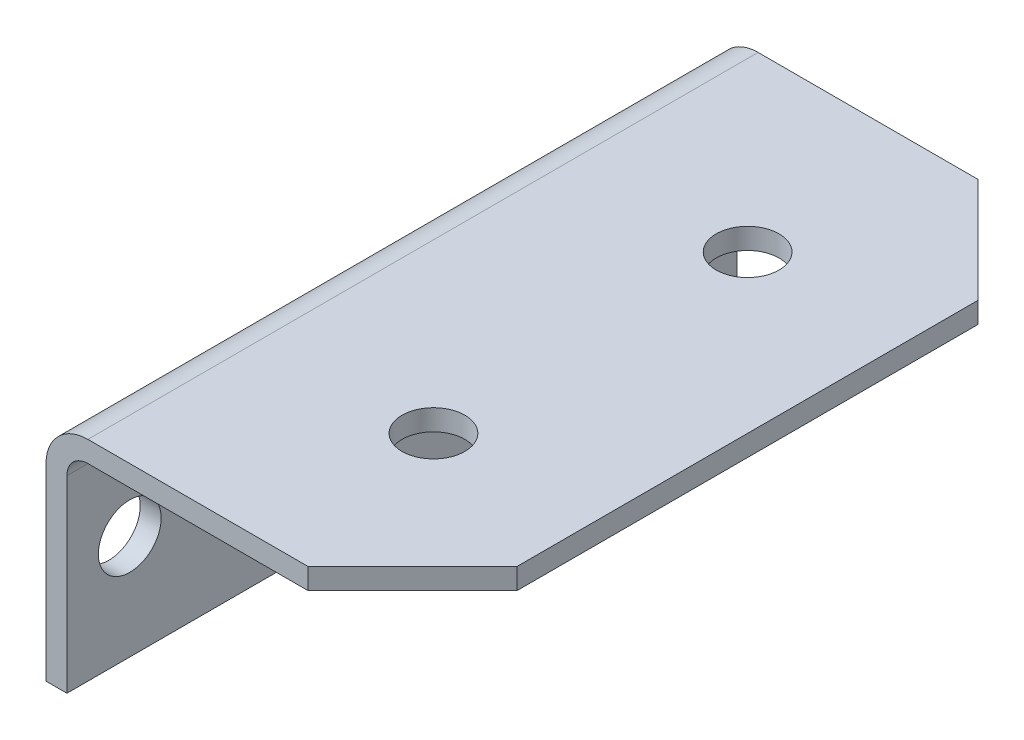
ISO-10303-21;
HEADER;
FILE_DESCRIPTION(('STEP AP214'),'2;1');
FILE_NAME('part.step','',(''),(''),'','','');
FILE_SCHEMA(('AUTOMOTIVE_DESIGN { 1 0 10303 214 1 1 1 1 }'));
ENDSEC;
DATA;
#1=APPLICATION_CONTEXT('core data for automotive mechanical design processes');
#2=APPLICATION_PROTOCOL_DEFINITION('international standard','automotive_design',2000,#1);
#3=PRODUCT_CONTEXT('',#1,'mechanical');
#4=PRODUCT('Part','Part','',(#3));
#5=PRODUCT_RELATED_PRODUCT_CATEGORY('part','',(#4));
#6=PRODUCT_DEFINITION_FORMATION('','',#4);
#7=PRODUCT_DEFINITION_CONTEXT('part definition',#1,'design');
#8=PRODUCT_DEFINITION('design','',#6,#7);
#9=PRODUCT_DEFINITION_SHAPE('','',#8);
#10=(LENGTH_UNIT() NAMED_UNIT(*) SI_UNIT(.MILLI.,.METRE.));
#11=(NAMED_UNIT(*) PLANE_ANGLE_UNIT() SI_UNIT($,.RADIAN.));
#12=(NAMED_UNIT(*) SI_UNIT($,.STERADIAN.) SOLID_ANGLE_UNIT());
#13=UNCERTAINTY_MEASURE_WITH_UNIT(LENGTH_MEASURE(1.E-05),#10,'distance_accuracy_value','');
#14=(GEOMETRIC_REPRESENTATION_CONTEXT(3) GLOBAL_UNCERTAINTY_ASSIGNED_CONTEXT((#13)) GLOBAL_UNIT_ASSIGNED_CONTEXT((#10,
#11,#12)) REPRESENTATION_CONTEXT('',''));
#15=CARTESIAN_POINT('',(0.,0.,0.));
#16=DIRECTION('',(0.,0.,1.));
#17=DIRECTION('',(1.,0.,0.));
#18=AXIS2_PLACEMENT_3D('',#15,#16,#17);
#19=CARTESIAN_POINT('',(2.,0.,64.));
#20=DIRECTION('',(0.,1.,0.));
#21=DIRECTION('',(-1.,0.,0.));
#22=AXIS2_PLACEMENT_3D('',#19,#20,#21);
#23=PLANE('',#22);
#24=DIRECTION('',(1.,0.,0.));
#25=VECTOR('',#24,1.);
#26=CARTESIAN_POINT('',(2.,0.,0.));
#27=LINE('',#26,#25);
#28=CARTESIAN_POINT('',(0.,0.,0.));
#29=VERTEX_POINT('',#28);
#30=CARTESIAN_POINT('',(2.,0.,0.));
#31=VERTEX_POINT('',#30);
#32=EDGE_CURVE('E115',#29,#31,#27,.T.);
#33=ORIENTED_EDGE('',*,*,#32,.T.);
#34=DIRECTION('',(0.,0.,-1.));
#35=VECTOR('',#34,1.);
#36=CARTESIAN_POINT('',(2.,0.,64.));
#37=LINE('',#36,#35);
#38=CARTESIAN_POINT('',(2.,0.,64.));
#39=VERTEX_POINT('',#38);
#40=EDGE_CURVE('E122',#39,#31,#37,.T.);
#41=ORIENTED_EDGE('',*,*,#40,.F.);
#42=DIRECTION('',(1.,0.,0.));
#43=VECTOR('',#42,1.);
#44=CARTESIAN_POINT('',(2.,0.,64.));
#45=LINE('',#44,#43);
#46=CARTESIAN_POINT('',(0.,0.,64.));
#47=VERTEX_POINT('',#46);
#48=EDGE_CURVE('E148',#47,#39,#45,.T.);
#49=ORIENTED_EDGE('',*,*,#48,.F.);
#50=DIRECTION('',(0.,0.,-1.));
#51=VECTOR('',#50,1.);
#52=CARTESIAN_POINT('',(0.,0.,64.));
#53=LINE('',#52,#51);
#54=EDGE_CURVE('E134',#47,#29,#53,.T.);
#55=ORIENTED_EDGE('',*,*,#54,.T.);
#56=EDGE_LOOP('',(#33,#41,#49,#55));
#57=FACE_BOUND('',#56,.T.);
#58=ADVANCED_FACE('F31',(#57),#23,.F.);
#59=CARTESIAN_POINT('',(1.99999999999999,20.,64.));
#60=DIRECTION('',(-1.,0.,0.));
#61=DIRECTION('',(0.,-1.,0.));
#62=AXIS2_PLACEMENT_3D('',#59,#60,#61);
#63=PLANE('',#62);
#64=CARTESIAN_POINT('',(2.,10.,6.00000000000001));
#65=DIRECTION('',(1.,0.,0.));
#66=DIRECTION('',(0.,1.,0.));
#67=AXIS2_PLACEMENT_3D('',#64,#65,#66);
#68=CIRCLE('',#67,3.);
#69=CARTESIAN_POINT('',(2.,13.,6.00000000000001));
#70=VERTEX_POINT('',#69);
#71=EDGE_CURVE('E185',#70,#70,#68,.T.);
#72=ORIENTED_EDGE('',*,*,#71,.F.);
#73=EDGE_LOOP('',(#72));
#74=FACE_BOUND('',#73,.T.);
#75=CARTESIAN_POINT('',(2.,10.,58.));
#76=DIRECTION('',(1.,0.,0.));
#77=DIRECTION('',(0.,1.,0.));
#78=AXIS2_PLACEMENT_3D('',#75,#76,#77);
#79=CIRCLE('',#78,3.);
#80=CARTESIAN_POINT('',(2.,13.,58.));
#81=VERTEX_POINT('',#80);
#82=EDGE_CURVE('E138',#81,#81,#79,.T.);
#83=ORIENTED_EDGE('',*,*,#82,.F.);
#84=EDGE_LOOP('',(#83));
#85=FACE_BOUND('',#84,.T.);
#86=DIRECTION('',(0.,1.,0.));
#87=VECTOR('',#86,1.);
#88=CARTESIAN_POINT('',(1.99999999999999,20.,0.));
#89=LINE('',#88,#87);
#90=CARTESIAN_POINT('',(2.,18.,0.));
#91=VERTEX_POINT('',#90);
#92=EDGE_CURVE('E110',#31,#91,#89,.T.);
#93=ORIENTED_EDGE('',*,*,#92,.T.);
#94=DIRECTION('',(0.,0.,-1.));
#95=VECTOR('',#94,1.);
#96=CARTESIAN_POINT('',(2.,18.,64.));
#97=LINE('',#96,#95);
#98=CARTESIAN_POINT('',(2.,18.,64.));
#99=VERTEX_POINT('',#98);
#100=EDGE_CURVE('E165',#91,#99,#97,.F.);
#101=ORIENTED_EDGE('',*,*,#100,.T.);
#102=DIRECTION('',(0.,1.,0.));
#103=VECTOR('',#102,1.);
#104=CARTESIAN_POINT('',(1.99999999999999,20.,64.));
#105=LINE('',#104,#103);
#106=EDGE_CURVE('E125',#39,#99,#105,.T.);
#107=ORIENTED_EDGE('',*,*,#106,.F.);
#108=ORIENTED_EDGE('',*,*,#40,.T.);
#109=EDGE_LOOP('',(#93,#101,#107,#108));
#110=FACE_BOUND('',#109,.T.);
#111=ADVANCED_FACE('F123',(#74,#85,#110),#63,.F.);
#112=CARTESIAN_POINT('',(35.,20.,64.));
#113=DIRECTION('',(0.,1.,0.));
#114=DIRECTION('',(-1.,0.,0.));
#115=AXIS2_PLACEMENT_3D('',#112,#113,#114);
#116=PLANE('',#115);
#117=CARTESIAN_POINT('',(20.,20.,47.));
#118=DIRECTION('',(0.,1.,0.));
#119=DIRECTION('',(-1.,0.,0.));
#120=AXIS2_PLACEMENT_3D('',#117,#118,#119);
#121=CIRCLE('',#120,3.);
#122=CARTESIAN_POINT('',(17.,20.,47.));
#123=VERTEX_POINT('',#122);
#124=EDGE_CURVE('E279',#123,#123,#121,.T.);
#125=ORIENTED_EDGE('',*,*,#124,.T.);
#126=EDGE_LOOP('',(#125));
#127=FACE_BOUND('',#126,.T.);
#128=CARTESIAN_POINT('',(20.,20.,17.));
#129=DIRECTION('',(0.,1.,0.));
#130=DIRECTION('',(-1.,0.,0.));
#131=AXIS2_PLACEMENT_3D('',#128,#129,#130);
#132=CIRCLE('',#131,3.);
#133=CARTESIAN_POINT('',(17.,20.,17.));
#134=VERTEX_POINT('',#133);
#135=EDGE_CURVE('E283',#134,#134,#132,.T.);
#136=ORIENTED_EDGE('',*,*,#135,.T.);
#137=EDGE_LOOP('',(#136));
#138=FACE_BOUND('',#137,.T.);
#139=DIRECTION('',(1.,0.,0.));
#140=VECTOR('',#139,1.);
#141=CARTESIAN_POINT('',(35.,20.,0.));
#142=LINE('',#141,#140);
#143=CARTESIAN_POINT('',(4.,20.,0.));
#144=VERTEX_POINT('',#143);
#145=CARTESIAN_POINT('',(25.,20.,0.));
#146=VERTEX_POINT('',#145);
#147=EDGE_CURVE('E119',#144,#146,#142,.T.);
#148=ORIENTED_EDGE('',*,*,#147,.T.);
#149=DIRECTION('',(0.707106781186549,0.,0.707106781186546));
#150=VECTOR('',#149,1.);
#151=CARTESIAN_POINT('',(35.,20.,10.));
#152=LINE('',#151,#150);
#153=CARTESIAN_POINT('',(35.,20.,10.));
#154=VERTEX_POINT('',#153);
#155=EDGE_CURVE('E38',#146,#154,#152,.T.);
#156=ORIENTED_EDGE('',*,*,#155,.T.);
#157=DIRECTION('',(0.,0.,-1.));
#158=VECTOR('',#157,1.);
#159=CARTESIAN_POINT('',(35.,20.,64.));
#160=LINE('',#159,#158);
#161=CARTESIAN_POINT('',(35.,20.,54.));
#162=VERTEX_POINT('',#161);
#163=EDGE_CURVE('E130',#162,#154,#160,.T.);
#164=ORIENTED_EDGE('',*,*,#163,.F.);
#165=DIRECTION('',(0.707106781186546,0.,-0.707106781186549));
#166=VECTOR('',#165,1.);
#167=CARTESIAN_POINT('',(25.,20.,64.));
#168=LINE('',#167,#166);
#169=CARTESIAN_POINT('',(25.,20.,64.));
#170=VERTEX_POINT('',#169);
#171=EDGE_CURVE('E45',#162,#170,#168,.F.);
#172=ORIENTED_EDGE('',*,*,#171,.T.);
#173=DIRECTION('',(1.,0.,0.));
#174=VECTOR('',#173,1.);
#175=CARTESIAN_POINT('',(35.,20.,64.));
#176=LINE('',#175,#174);
#177=CARTESIAN_POINT('',(4.,20.,64.));
#178=VERTEX_POINT('',#177);
#179=EDGE_CURVE('E151',#178,#170,#176,.T.);
#180=ORIENTED_EDGE('',*,*,#179,.F.);
#181=DIRECTION('',(0.,0.,-1.));
#182=VECTOR('',#181,1.);
#183=CARTESIAN_POINT('',(4.,20.,0.));
#184=LINE('',#183,#182);
#185=EDGE_CURVE('E129',#178,#144,#184,.T.);
#186=ORIENTED_EDGE('',*,*,#185,.T.);
#187=EDGE_LOOP('',(#148,#156,#164,#172,#180,#186));
#188=FACE_BOUND('',#187,.T.);
#189=ADVANCED_FACE('F196',(#127,#138,#188),#116,.F.);
#190=CARTESIAN_POINT('',(35.,22.,64.));
#191=DIRECTION('',(-1.,0.,0.));
#192=DIRECTION('',(0.,0.,1.));
#193=AXIS2_PLACEMENT_3D('',#190,#191,#192);
#194=PLANE('',#193);
#195=ORIENTED_EDGE('',*,*,#163,.T.);
#196=DIRECTION('',(0.,1.,0.));
#197=VECTOR('',#196,1.);
#198=CARTESIAN_POINT('',(35.,22.,10.));
#199=LINE('',#198,#197);
#200=CARTESIAN_POINT('',(35.,22.,10.));
#201=VERTEX_POINT('',#200);
#202=EDGE_CURVE('E187',#154,#201,#199,.T.);
#203=ORIENTED_EDGE('',*,*,#202,.T.);
#204=DIRECTION('',(0.,0.,-1.));
#205=VECTOR('',#204,1.);
#206=CARTESIAN_POINT('',(35.,22.,64.));
#207=LINE('',#206,#205);
#208=CARTESIAN_POINT('',(35.,22.,54.));
#209=VERTEX_POINT('',#208);
#210=EDGE_CURVE('E158',#209,#201,#207,.T.);
#211=ORIENTED_EDGE('',*,*,#210,.F.);
#212=DIRECTION('',(0.,-1.,0.));
#213=VECTOR('',#212,1.);
#214=CARTESIAN_POINT('',(35.,22.,54.));
#215=LINE('',#214,#213);
#216=EDGE_CURVE('E180',#209,#162,#215,.T.);
#217=ORIENTED_EDGE('',*,*,#216,.T.);
#218=EDGE_LOOP('',(#195,#203,#211,#217));
#219=FACE_BOUND('',#218,.T.);
#220=ADVANCED_FACE('F200',(#219),#194,.F.);
#221=CARTESIAN_POINT('',(0.,22.,64.));
#222=DIRECTION('',(0.,-1.,0.));
#223=DIRECTION('',(0.,0.,-1.));
#224=AXIS2_PLACEMENT_3D('',#221,#222,#223);
#225=PLANE('',#224);
#226=CARTESIAN_POINT('',(20.,22.,47.));
#227=DIRECTION('',(0.,1.,0.));
#228=DIRECTION('',(0.,0.,1.));
#229=AXIS2_PLACEMENT_3D('',#226,#227,#228);
#230=CIRCLE('',#229,3.);
#231=CARTESIAN_POINT('',(20.,22.,50.));
#232=VERTEX_POINT('',#231);
#233=EDGE_CURVE('E276',#232,#232,#230,.T.);
#234=ORIENTED_EDGE('',*,*,#233,.F.);
#235=EDGE_LOOP('',(#234));
#236=FACE_BOUND('',#235,.T.);
#237=CARTESIAN_POINT('',(20.,22.,17.));
#238=DIRECTION('',(0.,1.,0.));
#239=DIRECTION('',(0.,0.,1.));
#240=AXIS2_PLACEMENT_3D('',#237,#238,#239);
#241=CIRCLE('',#240,3.);
#242=CARTESIAN_POINT('',(20.,22.,20.));
#243=VERTEX_POINT('',#242);
#244=EDGE_CURVE('E280',#243,#243,#241,.T.);
#245=ORIENTED_EDGE('',*,*,#244,.F.);
#246=EDGE_LOOP('',(#245));
#247=FACE_BOUND('',#246,.T.);
#248=ORIENTED_EDGE('',*,*,#210,.T.);
#249=DIRECTION('',(-0.707106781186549,0.,-0.707106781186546));
#250=VECTOR('',#249,1.);
#251=CARTESIAN_POINT('',(35.,22.,10.));
#252=LINE('',#251,#250);
#253=CARTESIAN_POINT('',(25.,22.,0.));
#254=VERTEX_POINT('',#253);
#255=EDGE_CURVE('E192',#201,#254,#252,.T.);
#256=ORIENTED_EDGE('',*,*,#255,.T.);
#257=DIRECTION('',(-1.,0.,0.));
#258=VECTOR('',#257,1.);
#259=CARTESIAN_POINT('',(0.,22.,0.));
#260=LINE('',#259,#258);
#261=CARTESIAN_POINT('',(4.,22.,0.));
#262=VERTEX_POINT('',#261);
#263=EDGE_CURVE('E144',#254,#262,#260,.T.);
#264=ORIENTED_EDGE('',*,*,#263,.T.);
#265=DIRECTION('',(0.,0.,-1.));
#266=VECTOR('',#265,1.);
#267=CARTESIAN_POINT('',(4.,22.,64.));
#268=LINE('',#267,#266);
#269=CARTESIAN_POINT('',(4.,22.,64.));
#270=VERTEX_POINT('',#269);
#271=EDGE_CURVE('E176',#262,#270,#268,.F.);
#272=ORIENTED_EDGE('',*,*,#271,.T.);
#273=DIRECTION('',(-1.,0.,0.));
#274=VECTOR('',#273,1.);
#275=CARTESIAN_POINT('',(0.,22.,64.));
#276=LINE('',#275,#274);
#277=CARTESIAN_POINT('',(25.,22.,64.));
#278=VERTEX_POINT('',#277);
#279=EDGE_CURVE('E153',#278,#270,#276,.T.);
#280=ORIENTED_EDGE('',*,*,#279,.F.);
#281=DIRECTION('',(-0.707106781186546,0.,0.707106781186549));
#282=VECTOR('',#281,1.);
#283=CARTESIAN_POINT('',(25.,22.,64.));
#284=LINE('',#283,#282);
#285=EDGE_CURVE('E190',#278,#209,#284,.F.);
#286=ORIENTED_EDGE('',*,*,#285,.T.);
#287=EDGE_LOOP('',(#248,#256,#264,#272,#280,#286));
#288=FACE_BOUND('',#287,.T.);
#289=ADVANCED_FACE('F205',(#236,#247,#288),#225,.F.);
#290=CARTESIAN_POINT('',(0.,0.,64.));
#291=DIRECTION('',(1.,0.,0.));
#292=DIRECTION('',(0.,0.,-1.));
#293=AXIS2_PLACEMENT_3D('',#290,#291,#292);
#294=PLANE('',#293);
#295=CARTESIAN_POINT('',(0.,10.,6.00000000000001));
#296=DIRECTION('',(1.,0.,0.));
#297=DIRECTION('',(0.,0.,-1.));
#298=AXIS2_PLACEMENT_3D('',#295,#296,#297);
#299=CIRCLE('',#298,3.);
#300=CARTESIAN_POINT('',(0.,10.,3.00000000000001));
#301=VERTEX_POINT('',#300);
#302=EDGE_CURVE('E182',#301,#301,#299,.T.);
#303=ORIENTED_EDGE('',*,*,#302,.T.);
#304=EDGE_LOOP('',(#303));
#305=FACE_BOUND('',#304,.T.);
#306=CARTESIAN_POINT('',(0.,10.,58.));
#307=DIRECTION('',(1.,0.,0.));
#308=DIRECTION('',(0.,0.,-1.));
#309=AXIS2_PLACEMENT_3D('',#306,#307,#308);
#310=CIRCLE('',#309,3.);
#311=CARTESIAN_POINT('',(0.,10.,55.));
#312=VERTEX_POINT('',#311);
#313=EDGE_CURVE('E135',#312,#312,#310,.T.);
#314=ORIENTED_EDGE('',*,*,#313,.T.);
#315=EDGE_LOOP('',(#314));
#316=FACE_BOUND('',#315,.T.);
#317=DIRECTION('',(0.,-1.,0.));
#318=VECTOR('',#317,1.);
#319=CARTESIAN_POINT('',(0.,0.,64.));
#320=LINE('',#319,#318);
#321=CARTESIAN_POINT('',(0.,18.,64.));
#322=VERTEX_POINT('',#321);
#323=EDGE_CURVE('E155',#322,#47,#320,.T.);
#324=ORIENTED_EDGE('',*,*,#323,.F.);
#325=DIRECTION('',(0.,0.,-1.));
#326=VECTOR('',#325,1.);
#327=CARTESIAN_POINT('',(0.,18.,64.));
#328=LINE('',#327,#326);
#329=CARTESIAN_POINT('',(0.,18.,0.));
#330=VERTEX_POINT('',#329);
#331=EDGE_CURVE('E170',#322,#330,#328,.T.);
#332=ORIENTED_EDGE('',*,*,#331,.T.);
#333=DIRECTION('',(0.,-1.,0.));
#334=VECTOR('',#333,1.);
#335=CARTESIAN_POINT('',(0.,0.,0.));
#336=LINE('',#335,#334);
#337=EDGE_CURVE('E146',#330,#29,#336,.T.);
#338=ORIENTED_EDGE('',*,*,#337,.T.);
#339=ORIENTED_EDGE('',*,*,#54,.F.);
#340=EDGE_LOOP('',(#324,#332,#338,#339));
#341=FACE_BOUND('',#340,.T.);
#342=ADVANCED_FACE('F242',(#305,#316,#341),#294,.F.);
#343=CARTESIAN_POINT('',(0.,0.,64.));
#344=DIRECTION('',(0.,0.,-1.));
#345=DIRECTION('',(-1.,0.,0.));
#346=AXIS2_PLACEMENT_3D('',#343,#344,#345);
#347=PLANE('',#346);
#348=ORIENTED_EDGE('',*,*,#179,.T.);
#349=DIRECTION('',(0.,1.,0.));
#350=VECTOR('',#349,1.);
#351=CARTESIAN_POINT('',(25.,0.,64.));
#352=LINE('',#351,#350);
#353=EDGE_CURVE('E11',#170,#278,#352,.T.);
#354=ORIENTED_EDGE('',*,*,#353,.T.);
#355=ORIENTED_EDGE('',*,*,#279,.T.);
#356=CARTESIAN_POINT('',(4.,18.,64.));
#357=DIRECTION('',(0.,0.,-1.));
#358=DIRECTION('',(-1.,0.,0.));
#359=AXIS2_PLACEMENT_3D('',#356,#357,#358);
#360=CIRCLE('',#359,4.);
#361=EDGE_CURVE('E179',#270,#322,#360,.F.);
#362=ORIENTED_EDGE('',*,*,#361,.T.);
#363=ORIENTED_EDGE('',*,*,#323,.T.);
#364=ORIENTED_EDGE('',*,*,#48,.T.);
#365=ORIENTED_EDGE('',*,*,#106,.T.);
#366=CARTESIAN_POINT('',(4.,18.,64.));
#367=DIRECTION('',(0.,0.,-1.));
#368=DIRECTION('',(-1.,0.,0.));
#369=AXIS2_PLACEMENT_3D('',#366,#367,#368);
#370=CIRCLE('',#369,2.);
#371=EDGE_CURVE('E168',#99,#178,#370,.T.);
#372=ORIENTED_EDGE('',*,*,#371,.T.);
#373=EDGE_LOOP('',(#348,#354,#355,#362,#363,#364,#365,#372));
#374=FACE_BOUND('',#373,.T.);
#375=ADVANCED_FACE('F213',(#374),#347,.F.);
#376=CARTESIAN_POINT('',(0.,0.,0.));
#377=DIRECTION('',(0.,0.,-1.));
#378=DIRECTION('',(-1.,0.,0.));
#379=AXIS2_PLACEMENT_3D('',#376,#377,#378);
#380=PLANE('',#379);
#381=ORIENTED_EDGE('',*,*,#263,.F.);
#382=DIRECTION('',(0.,-1.,0.));
#383=VECTOR('',#382,1.);
#384=CARTESIAN_POINT('',(25.,20.,0.));
#385=LINE('',#384,#383);
#386=EDGE_CURVE('E53',#254,#146,#385,.T.);
#387=ORIENTED_EDGE('',*,*,#386,.T.);
#388=ORIENTED_EDGE('',*,*,#147,.F.);
#389=CARTESIAN_POINT('',(4.,18.,0.));
#390=DIRECTION('',(0.,0.,-1.));
#391=DIRECTION('',(-1.,0.,0.));
#392=AXIS2_PLACEMENT_3D('',#389,#390,#391);
#393=CIRCLE('',#392,2.);
#394=EDGE_CURVE('E116',#144,#91,#393,.F.);
#395=ORIENTED_EDGE('',*,*,#394,.T.);
#396=ORIENTED_EDGE('',*,*,#92,.F.);
#397=ORIENTED_EDGE('',*,*,#32,.F.);
#398=ORIENTED_EDGE('',*,*,#337,.F.);
#399=CARTESIAN_POINT('',(4.,18.,0.));
#400=DIRECTION('',(0.,0.,-1.));
#401=DIRECTION('',(-1.,0.,0.));
#402=AXIS2_PLACEMENT_3D('',#399,#400,#401);
#403=CIRCLE('',#402,4.);
#404=EDGE_CURVE('E173',#330,#262,#403,.T.);
#405=ORIENTED_EDGE('',*,*,#404,.T.);
#406=EDGE_LOOP('',(#381,#387,#388,#395,#396,#397,#398,#405));
#407=FACE_BOUND('',#406,.T.);
#408=ADVANCED_FACE('F112',(#407),#380,.T.);
#409=CARTESIAN_POINT('',(4.,18.,64.));
#410=DIRECTION('',(0.,0.,1.));
#411=DIRECTION('',(1.,0.,0.));
#412=AXIS2_PLACEMENT_3D('',#409,#410,#411);
#413=CYLINDRICAL_SURFACE('',#412,2.);
#414=ORIENTED_EDGE('',*,*,#371,.F.);
#415=ORIENTED_EDGE('',*,*,#100,.F.);
#416=ORIENTED_EDGE('',*,*,#394,.F.);
#417=ORIENTED_EDGE('',*,*,#185,.F.);
#418=EDGE_LOOP('',(#414,#415,#416,#417));
#419=FACE_BOUND('',#418,.T.);
#420=ADVANCED_FACE('F251',(#419),#413,.F.);
#421=CARTESIAN_POINT('',(4.,18.,64.));
#422=DIRECTION('',(0.,0.,-1.));
#423=DIRECTION('',(-1.,0.,0.));
#424=AXIS2_PLACEMENT_3D('',#421,#422,#423);
#425=CYLINDRICAL_SURFACE('',#424,4.);
#426=ORIENTED_EDGE('',*,*,#361,.F.);
#427=ORIENTED_EDGE('',*,*,#271,.F.);
#428=ORIENTED_EDGE('',*,*,#404,.F.);
#429=ORIENTED_EDGE('',*,*,#331,.F.);
#430=EDGE_LOOP('',(#426,#427,#428,#429));
#431=FACE_BOUND('',#430,.T.);
#432=ADVANCED_FACE('F210',(#431),#425,.T.);
#433=CARTESIAN_POINT('',(-8.,9.99999999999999,58.));
#434=DIRECTION('',(1.,0.,0.));
#435=DIRECTION('',(0.,1.,0.));
#436=AXIS2_PLACEMENT_3D('',#433,#434,#435);
#437=CYLINDRICAL_SURFACE('',#436,3.);
#438=ORIENTED_EDGE('',*,*,#82,.T.);
#439=EDGE_LOOP('',(#438));
#440=FACE_BOUND('',#439,.T.);
#441=ORIENTED_EDGE('',*,*,#313,.F.);
#442=EDGE_LOOP('',(#441));
#443=FACE_BOUND('',#442,.T.);
#444=ADVANCED_FACE('F257',(#440,#443),#437,.F.);
#445=CARTESIAN_POINT('',(-8.,9.99999999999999,6.00000000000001));
#446=DIRECTION('',(1.,0.,0.));
#447=DIRECTION('',(0.,1.,0.));
#448=AXIS2_PLACEMENT_3D('',#445,#446,#447);
#449=CYLINDRICAL_SURFACE('',#448,3.);
#450=ORIENTED_EDGE('',*,*,#71,.T.);
#451=EDGE_LOOP('',(#450));
#452=FACE_BOUND('',#451,.T.);
#453=ORIENTED_EDGE('',*,*,#302,.F.);
#454=EDGE_LOOP('',(#453));
#455=FACE_BOUND('',#454,.T.);
#456=ADVANCED_FACE('F260',(#452,#455),#449,.F.);
#457=CARTESIAN_POINT('',(20.,12.,17.));
#458=DIRECTION('',(0.,1.,0.));
#459=DIRECTION('',(0.,0.,1.));
#460=AXIS2_PLACEMENT_3D('',#457,#458,#459);
#461=CYLINDRICAL_SURFACE('',#460,3.);
#462=ORIENTED_EDGE('',*,*,#244,.T.);
#463=EDGE_LOOP('',(#462));
#464=FACE_BOUND('',#463,.T.);
#465=ORIENTED_EDGE('',*,*,#135,.F.);
#466=EDGE_LOOP('',(#465));
#467=FACE_BOUND('',#466,.T.);
#468=ADVANCED_FACE('F264',(#464,#467),#461,.F.);
#469=CARTESIAN_POINT('',(20.,12.,47.));
#470=DIRECTION('',(0.,1.,0.));
#471=DIRECTION('',(0.,0.,1.));
#472=AXIS2_PLACEMENT_3D('',#469,#470,#471);
#473=CYLINDRICAL_SURFACE('',#472,3.);
#474=ORIENTED_EDGE('',*,*,#233,.T.);
#475=EDGE_LOOP('',(#474));
#476=FACE_BOUND('',#475,.T.);
#477=ORIENTED_EDGE('',*,*,#124,.F.);
#478=EDGE_LOOP('',(#477));
#479=FACE_BOUND('',#478,.T.);
#480=ADVANCED_FACE('F223',(#476,#479),#473,.F.);
#481=CARTESIAN_POINT('',(35.,22.,10.));
#482=DIRECTION('',(0.707106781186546,0.,-0.707106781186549));
#483=DIRECTION('',(-0.707106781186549,0.,-0.707106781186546));
#484=AXIS2_PLACEMENT_3D('',#481,#482,#483);
#485=PLANE('',#484);
#486=ORIENTED_EDGE('',*,*,#155,.F.);
#487=ORIENTED_EDGE('',*,*,#386,.F.);
#488=ORIENTED_EDGE('',*,*,#255,.F.);
#489=ORIENTED_EDGE('',*,*,#202,.F.);
#490=EDGE_LOOP('',(#486,#487,#488,#489));
#491=FACE_BOUND('',#490,.T.);
#492=ADVANCED_FACE('F203',(#491),#485,.T.);
#493=CARTESIAN_POINT('',(25.,0.,64.));
#494=DIRECTION('',(-0.707106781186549,0.,-0.707106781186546));
#495=DIRECTION('',(-0.707106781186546,0.,0.707106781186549));
#496=AXIS2_PLACEMENT_3D('',#493,#494,#495);
#497=PLANE('',#496);
#498=ORIENTED_EDGE('',*,*,#171,.F.);
#499=ORIENTED_EDGE('',*,*,#216,.F.);
#500=ORIENTED_EDGE('',*,*,#285,.F.);
#501=ORIENTED_EDGE('',*,*,#353,.F.);
#502=EDGE_LOOP('',(#498,#499,#500,#501));
#503=FACE_BOUND('',#502,.T.);
#504=ADVANCED_FACE('F217',(#503),#497,.F.);
#505=CLOSED_SHELL('',(#58,#111,#189,#220,#289,#342,#375,#408,#420,#432,#444,#456,#468,#480,#492,#504));
#506=MANIFOLD_SOLID_BREP('B2',#505);
#507=ADVANCED_BREP_SHAPE_REPRESENTATION('',(#18,#506),#14);
#508=SHAPE_DEFINITION_REPRESENTATION(#9,#507);
ENDSEC;
END-ISO-10303-21;
